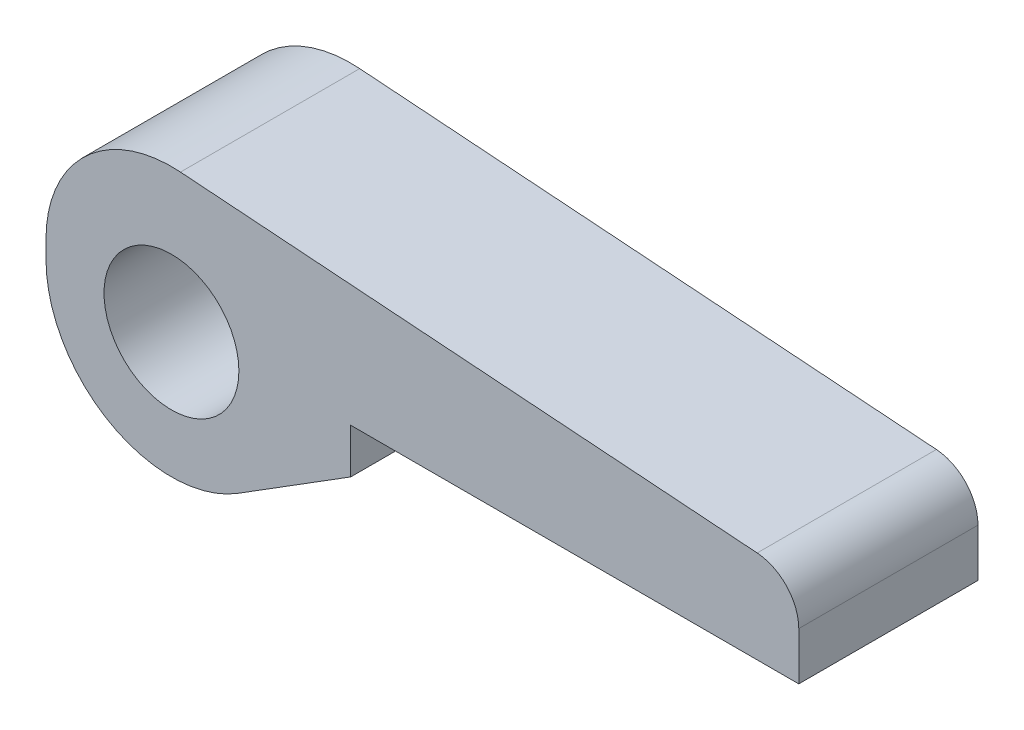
ISO-10303-21;
HEADER;
FILE_DESCRIPTION(('STEP AP214'),'2;1');
FILE_NAME('part.step','',(''),(''),'','','');
FILE_SCHEMA(('AUTOMOTIVE_DESIGN { 1 0 10303 214 1 1 1 1 }'));
ENDSEC;
DATA;
#1=APPLICATION_CONTEXT('core data for automotive mechanical design processes');
#2=APPLICATION_PROTOCOL_DEFINITION('international standard','automotive_design',2000,#1);
#3=PRODUCT_CONTEXT('',#1,'mechanical');
#4=PRODUCT('Part','Part','',(#3));
#5=PRODUCT_RELATED_PRODUCT_CATEGORY('part','',(#4));
#6=PRODUCT_DEFINITION_FORMATION('','',#4);
#7=PRODUCT_DEFINITION_CONTEXT('part definition',#1,'design');
#8=PRODUCT_DEFINITION('design','',#6,#7);
#9=PRODUCT_DEFINITION_SHAPE('','',#8);
#10=(LENGTH_UNIT() NAMED_UNIT(*) SI_UNIT(.MILLI.,.METRE.));
#11=(NAMED_UNIT(*) PLANE_ANGLE_UNIT() SI_UNIT($,.RADIAN.));
#12=(NAMED_UNIT(*) SI_UNIT($,.STERADIAN.) SOLID_ANGLE_UNIT());
#13=UNCERTAINTY_MEASURE_WITH_UNIT(LENGTH_MEASURE(1.E-05),#10,'distance_accuracy_value','');
#14=(GEOMETRIC_REPRESENTATION_CONTEXT(3) GLOBAL_UNCERTAINTY_ASSIGNED_CONTEXT((#13)) GLOBAL_UNIT_ASSIGNED_CONTEXT((#10,
#11,#12)) REPRESENTATION_CONTEXT('',''));
#15=CARTESIAN_POINT('',(0.,0.,0.));
#16=DIRECTION('',(0.,0.,1.));
#17=DIRECTION('',(1.,0.,0.));
#18=AXIS2_PLACEMENT_3D('',#15,#16,#17);
#19=CARTESIAN_POINT('',(0.,0.,40.));
#20=DIRECTION('',(0.,0.,1.));
#21=DIRECTION('',(1.,0.,0.));
#22=AXIS2_PLACEMENT_3D('',#19,#20,#21);
#23=PLANE('',#22);
#24=DIRECTION('',(0.,1.,0.));
#25=VECTOR('',#24,1.);
#26=CARTESIAN_POINT('',(40.,0.,40.));
#27=LINE('',#26,#25);
#28=CARTESIAN_POINT('',(40.,-8.,40.));
#29=VERTEX_POINT('',#28);
#30=CARTESIAN_POINT('',(40.,2.,40.));
#31=VERTEX_POINT('',#30);
#32=EDGE_CURVE('E137',#29,#31,#27,.T.);
#33=ORIENTED_EDGE('',*,*,#32,.T.);
#34=DIRECTION('',(1.,0.,0.));
#35=VECTOR('',#34,1.);
#36=CARTESIAN_POINT('',(40.,2.,40.));
#37=LINE('',#36,#35);
#38=CARTESIAN_POINT('',(140.,2.,40.));
#39=VERTEX_POINT('',#38);
#40=EDGE_CURVE('E115',#31,#39,#37,.T.);
#41=ORIENTED_EDGE('',*,*,#40,.T.);
#42=DIRECTION('',(0.,1.,0.));
#43=VECTOR('',#42,1.);
#44=CARTESIAN_POINT('',(140.,2.,40.));
#45=LINE('',#44,#43);
#46=CARTESIAN_POINT('',(140.,12.6936078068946,40.));
#47=VERTEX_POINT('',#46);
#48=EDGE_CURVE('E140',#39,#47,#45,.T.);
#49=ORIENTED_EDGE('',*,*,#48,.T.);
#50=CARTESIAN_POINT('',(130.,12.6936078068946,40.));
#51=DIRECTION('',(0.,0.,1.));
#52=DIRECTION('',(1.,0.,0.));
#53=AXIS2_PLACEMENT_3D('',#50,#51,#52);
#54=CIRCLE('',#53,10.);
#55=CARTESIAN_POINT('',(130.717600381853,22.6678270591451,40.));
#56=VERTEX_POINT('',#55);
#57=EDGE_CURVE('E142',#47,#56,#54,.T.);
#58=ORIENTED_EDGE('',*,*,#57,.T.);
#59=DIRECTION('',(-0.997421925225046,0.0717600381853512,0.));
#60=VECTOR('',#59,1.);
#61=CARTESIAN_POINT('',(2.00928106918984,31.9278139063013,40.));
#62=LINE('',#61,#60);
#63=CARTESIAN_POINT('',(2.00928106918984,31.9278139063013,40.));
#64=VERTEX_POINT('',#63);
#65=EDGE_CURVE('E144',#56,#64,#62,.T.);
#66=ORIENTED_EDGE('',*,*,#65,.T.);
#67=CARTESIAN_POINT('',(0.,4.,40.));
#68=DIRECTION('',(0.,0.,1.));
#69=DIRECTION('',(-1.,0.,0.));
#70=AXIS2_PLACEMENT_3D('',#67,#68,#69);
#71=CIRCLE('',#70,28.);
#72=CARTESIAN_POINT('',(-28.,4.,40.));
#73=VERTEX_POINT('',#72);
#74=EDGE_CURVE('E146',#64,#73,#71,.T.);
#75=ORIENTED_EDGE('',*,*,#74,.T.);
#76=DIRECTION('',(0.,-1.,0.));
#77=VECTOR('',#76,1.);
#78=CARTESIAN_POINT('',(-28.,0.,40.));
#79=LINE('',#78,#77);
#80=CARTESIAN_POINT('',(-28.,0.,40.));
#81=VERTEX_POINT('',#80);
#82=EDGE_CURVE('E148',#73,#81,#79,.T.);
#83=ORIENTED_EDGE('',*,*,#82,.T.);
#84=CARTESIAN_POINT('',(0.,0.,40.));
#85=DIRECTION('',(0.,0.,1.));
#86=DIRECTION('',(1.,0.,0.));
#87=AXIS2_PLACEMENT_3D('',#84,#85,#86);
#88=CIRCLE('',#87,28.);
#89=CARTESIAN_POINT('',(14.8528161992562,-23.7359190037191,40.));
#90=VERTEX_POINT('',#89);
#91=EDGE_CURVE('E50',#81,#90,#88,.T.);
#92=ORIENTED_EDGE('',*,*,#91,.T.);
#93=DIRECTION('',(0.847711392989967,0.530457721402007,0.));
#94=VECTOR('',#93,1.);
#95=CARTESIAN_POINT('',(40.,-8.,40.));
#96=LINE('',#95,#94);
#97=EDGE_CURVE('E45',#90,#29,#96,.T.);
#98=ORIENTED_EDGE('',*,*,#97,.T.);
#99=EDGE_LOOP('',(#33,#41,#49,#58,#66,#75,#83,#92,#98));
#100=FACE_BOUND('',#99,.T.);
#101=CARTESIAN_POINT('',(0.,0.,40.));
#102=DIRECTION('',(0.,0.,1.));
#103=DIRECTION('',(1.,0.,0.));
#104=AXIS2_PLACEMENT_3D('',#101,#102,#103);
#105=CIRCLE('',#104,15.05);
#106=CARTESIAN_POINT('',(15.05,0.,40.));
#107=VERTEX_POINT('',#106);
#108=EDGE_CURVE('E109',#107,#107,#105,.T.);
#109=ORIENTED_EDGE('',*,*,#108,.F.);
#110=EDGE_LOOP('',(#109));
#111=FACE_BOUND('',#110,.T.);
#112=ADVANCED_FACE('F30',(#100,#111),#23,.T.);
#113=CARTESIAN_POINT('',(0.,0.,0.));
#114=DIRECTION('',(0.,0.,1.));
#115=DIRECTION('',(1.,0.,0.));
#116=AXIS2_PLACEMENT_3D('',#113,#114,#115);
#117=PLANE('',#116);
#118=DIRECTION('',(0.,1.,0.));
#119=VECTOR('',#118,1.);
#120=CARTESIAN_POINT('',(40.,0.,0.));
#121=LINE('',#120,#119);
#122=CARTESIAN_POINT('',(40.,-8.,0.));
#123=VERTEX_POINT('',#122);
#124=CARTESIAN_POINT('',(40.,2.,0.));
#125=VERTEX_POINT('',#124);
#126=EDGE_CURVE('E100',#123,#125,#121,.T.);
#127=ORIENTED_EDGE('',*,*,#126,.F.);
#128=DIRECTION('',(0.847711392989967,0.530457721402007,0.));
#129=VECTOR('',#128,1.);
#130=CARTESIAN_POINT('',(40.,-8.,0.));
#131=LINE('',#130,#129);
#132=CARTESIAN_POINT('',(14.8528161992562,-23.7359190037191,0.));
#133=VERTEX_POINT('',#132);
#134=EDGE_CURVE('E135',#133,#123,#131,.T.);
#135=ORIENTED_EDGE('',*,*,#134,.F.);
#136=CARTESIAN_POINT('',(0.,0.,0.));
#137=DIRECTION('',(0.,0.,1.));
#138=DIRECTION('',(1.,0.,0.));
#139=AXIS2_PLACEMENT_3D('',#136,#137,#138);
#140=CIRCLE('',#139,28.);
#141=CARTESIAN_POINT('',(-28.,0.,0.));
#142=VERTEX_POINT('',#141);
#143=EDGE_CURVE('E133',#142,#133,#140,.T.);
#144=ORIENTED_EDGE('',*,*,#143,.F.);
#145=DIRECTION('',(0.,-1.,0.));
#146=VECTOR('',#145,1.);
#147=CARTESIAN_POINT('',(-28.,0.,0.));
#148=LINE('',#147,#146);
#149=CARTESIAN_POINT('',(-28.,4.,0.));
#150=VERTEX_POINT('',#149);
#151=EDGE_CURVE('E131',#150,#142,#148,.T.);
#152=ORIENTED_EDGE('',*,*,#151,.F.);
#153=CARTESIAN_POINT('',(0.,4.,0.));
#154=DIRECTION('',(0.,0.,1.));
#155=DIRECTION('',(-1.,0.,0.));
#156=AXIS2_PLACEMENT_3D('',#153,#154,#155);
#157=CIRCLE('',#156,28.);
#158=CARTESIAN_POINT('',(2.00928106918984,31.9278139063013,0.));
#159=VERTEX_POINT('',#158);
#160=EDGE_CURVE('E129',#159,#150,#157,.T.);
#161=ORIENTED_EDGE('',*,*,#160,.F.);
#162=DIRECTION('',(-0.997421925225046,0.0717600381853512,0.));
#163=VECTOR('',#162,1.);
#164=CARTESIAN_POINT('',(2.00928106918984,31.9278139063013,0.));
#165=LINE('',#164,#163);
#166=CARTESIAN_POINT('',(130.717600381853,22.6678270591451,0.));
#167=VERTEX_POINT('',#166);
#168=EDGE_CURVE('E127',#167,#159,#165,.T.);
#169=ORIENTED_EDGE('',*,*,#168,.F.);
#170=CARTESIAN_POINT('',(130.,12.6936078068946,0.));
#171=DIRECTION('',(0.,0.,1.));
#172=DIRECTION('',(1.,0.,0.));
#173=AXIS2_PLACEMENT_3D('',#170,#171,#172);
#174=CIRCLE('',#173,10.);
#175=CARTESIAN_POINT('',(140.,12.6936078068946,0.));
#176=VERTEX_POINT('',#175);
#177=EDGE_CURVE('E122',#176,#167,#174,.T.);
#178=ORIENTED_EDGE('',*,*,#177,.F.);
#179=DIRECTION('',(0.,1.,0.));
#180=VECTOR('',#179,1.);
#181=CARTESIAN_POINT('',(140.,2.,0.));
#182=LINE('',#181,#180);
#183=CARTESIAN_POINT('',(140.,2.,0.));
#184=VERTEX_POINT('',#183);
#185=EDGE_CURVE('E120',#184,#176,#182,.T.);
#186=ORIENTED_EDGE('',*,*,#185,.F.);
#187=DIRECTION('',(1.,0.,0.));
#188=VECTOR('',#187,1.);
#189=CARTESIAN_POINT('',(40.,2.,0.));
#190=LINE('',#189,#188);
#191=EDGE_CURVE('E108',#125,#184,#190,.T.);
#192=ORIENTED_EDGE('',*,*,#191,.F.);
#193=EDGE_LOOP('',(#127,#135,#144,#152,#161,#169,#178,#186,#192));
#194=FACE_BOUND('',#193,.T.);
#195=CARTESIAN_POINT('',(0.,0.,0.));
#196=DIRECTION('',(0.,0.,1.));
#197=DIRECTION('',(1.,0.,0.));
#198=AXIS2_PLACEMENT_3D('',#195,#196,#197);
#199=CIRCLE('',#198,15.05);
#200=CARTESIAN_POINT('',(15.05,0.,0.));
#201=VERTEX_POINT('',#200);
#202=EDGE_CURVE('E303',#201,#201,#199,.T.);
#203=ORIENTED_EDGE('',*,*,#202,.T.);
#204=EDGE_LOOP('',(#203));
#205=FACE_BOUND('',#204,.T.);
#206=ADVANCED_FACE('F117',(#194,#205),#117,.F.);
#207=CARTESIAN_POINT('',(40.,0.,40.));
#208=DIRECTION('',(-1.,0.,0.));
#209=DIRECTION('',(0.,0.,1.));
#210=AXIS2_PLACEMENT_3D('',#207,#208,#209);
#211=PLANE('',#210);
#212=ORIENTED_EDGE('',*,*,#126,.T.);
#213=DIRECTION('',(0.,0.,-1.));
#214=VECTOR('',#213,1.);
#215=CARTESIAN_POINT('',(40.,2.,40.));
#216=LINE('',#215,#214);
#217=EDGE_CURVE('E11',#31,#125,#216,.T.);
#218=ORIENTED_EDGE('',*,*,#217,.F.);
#219=ORIENTED_EDGE('',*,*,#32,.F.);
#220=DIRECTION('',(0.,0.,-1.));
#221=VECTOR('',#220,1.);
#222=CARTESIAN_POINT('',(40.,-8.,40.));
#223=LINE('',#222,#221);
#224=EDGE_CURVE('E103',#29,#123,#223,.T.);
#225=ORIENTED_EDGE('',*,*,#224,.T.);
#226=EDGE_LOOP('',(#212,#218,#219,#225));
#227=FACE_BOUND('',#226,.T.);
#228=ADVANCED_FACE('F32',(#227),#211,.F.);
#229=CARTESIAN_POINT('',(40.,2.,40.));
#230=DIRECTION('',(0.,1.,0.));
#231=DIRECTION('',(0.,0.,1.));
#232=AXIS2_PLACEMENT_3D('',#229,#230,#231);
#233=PLANE('',#232);
#234=ORIENTED_EDGE('',*,*,#191,.T.);
#235=DIRECTION('',(0.,0.,-1.));
#236=VECTOR('',#235,1.);
#237=CARTESIAN_POINT('',(140.,2.,40.));
#238=LINE('',#237,#236);
#239=EDGE_CURVE('E38',#39,#184,#238,.T.);
#240=ORIENTED_EDGE('',*,*,#239,.F.);
#241=ORIENTED_EDGE('',*,*,#40,.F.);
#242=ORIENTED_EDGE('',*,*,#217,.T.);
#243=EDGE_LOOP('',(#234,#240,#241,#242));
#244=FACE_BOUND('',#243,.T.);
#245=ADVANCED_FACE('F112',(#244),#233,.F.);
#246=CARTESIAN_POINT('',(140.,2.,40.));
#247=DIRECTION('',(-1.,0.,0.));
#248=DIRECTION('',(0.,0.,1.));
#249=AXIS2_PLACEMENT_3D('',#246,#247,#248);
#250=PLANE('',#249);
#251=ORIENTED_EDGE('',*,*,#185,.T.);
#252=DIRECTION('',(0.,0.,-1.));
#253=VECTOR('',#252,1.);
#254=CARTESIAN_POINT('',(140.,12.6936078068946,40.));
#255=LINE('',#254,#253);
#256=EDGE_CURVE('E168',#47,#176,#255,.T.);
#257=ORIENTED_EDGE('',*,*,#256,.F.);
#258=ORIENTED_EDGE('',*,*,#48,.F.);
#259=ORIENTED_EDGE('',*,*,#239,.T.);
#260=EDGE_LOOP('',(#251,#257,#258,#259));
#261=FACE_BOUND('',#260,.T.);
#262=ADVANCED_FACE('F172',(#261),#250,.F.);
#263=CARTESIAN_POINT('',(130.,12.6936078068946,40.));
#264=DIRECTION('',(0.,0.,-1.));
#265=DIRECTION('',(-1.,0.,0.));
#266=AXIS2_PLACEMENT_3D('',#263,#264,#265);
#267=CYLINDRICAL_SURFACE('',#266,10.);
#268=ORIENTED_EDGE('',*,*,#177,.T.);
#269=DIRECTION('',(0.,0.,-1.));
#270=VECTOR('',#269,1.);
#271=CARTESIAN_POINT('',(130.717600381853,22.6678270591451,40.));
#272=LINE('',#271,#270);
#273=EDGE_CURVE('E165',#56,#167,#272,.T.);
#274=ORIENTED_EDGE('',*,*,#273,.F.);
#275=ORIENTED_EDGE('',*,*,#57,.F.);
#276=ORIENTED_EDGE('',*,*,#256,.T.);
#277=EDGE_LOOP('',(#268,#274,#275,#276));
#278=FACE_BOUND('',#277,.T.);
#279=ADVANCED_FACE('F180',(#278),#267,.T.);
#280=CARTESIAN_POINT('',(2.00928106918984,31.9278139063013,40.));
#281=DIRECTION('',(-0.0717600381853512,-0.997421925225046,0.));
#282=DIRECTION('',(0.997421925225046,-0.0717600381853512,0.));
#283=AXIS2_PLACEMENT_3D('',#280,#281,#282);
#284=PLANE('',#283);
#285=ORIENTED_EDGE('',*,*,#168,.T.);
#286=DIRECTION('',(0.,0.,-1.));
#287=VECTOR('',#286,1.);
#288=CARTESIAN_POINT('',(2.00928106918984,31.9278139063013,40.));
#289=LINE('',#288,#287);
#290=EDGE_CURVE('E162',#64,#159,#289,.T.);
#291=ORIENTED_EDGE('',*,*,#290,.F.);
#292=ORIENTED_EDGE('',*,*,#65,.F.);
#293=ORIENTED_EDGE('',*,*,#273,.T.);
#294=EDGE_LOOP('',(#285,#291,#292,#293));
#295=FACE_BOUND('',#294,.T.);
#296=ADVANCED_FACE('F183',(#295),#284,.F.);
#297=CARTESIAN_POINT('',(0.,4.,40.));
#298=DIRECTION('',(0.,0.,-1.));
#299=DIRECTION('',(-1.,0.,0.));
#300=AXIS2_PLACEMENT_3D('',#297,#298,#299);
#301=CYLINDRICAL_SURFACE('',#300,28.);
#302=ORIENTED_EDGE('',*,*,#160,.T.);
#303=DIRECTION('',(0.,0.,-1.));
#304=VECTOR('',#303,1.);
#305=CARTESIAN_POINT('',(-28.,4.,40.));
#306=LINE('',#305,#304);
#307=EDGE_CURVE('E159',#73,#150,#306,.T.);
#308=ORIENTED_EDGE('',*,*,#307,.F.);
#309=ORIENTED_EDGE('',*,*,#74,.F.);
#310=ORIENTED_EDGE('',*,*,#290,.T.);
#311=EDGE_LOOP('',(#302,#308,#309,#310));
#312=FACE_BOUND('',#311,.T.);
#313=ADVANCED_FACE('F188',(#312),#301,.T.);
#314=CARTESIAN_POINT('',(-28.,0.,40.));
#315=DIRECTION('',(1.,0.,0.));
#316=DIRECTION('',(0.,0.,-1.));
#317=AXIS2_PLACEMENT_3D('',#314,#315,#316);
#318=PLANE('',#317);
#319=ORIENTED_EDGE('',*,*,#151,.T.);
#320=DIRECTION('',(0.,0.,-1.));
#321=VECTOR('',#320,1.);
#322=CARTESIAN_POINT('',(-28.,0.,40.));
#323=LINE('',#322,#321);
#324=EDGE_CURVE('E156',#81,#142,#323,.T.);
#325=ORIENTED_EDGE('',*,*,#324,.F.);
#326=ORIENTED_EDGE('',*,*,#82,.F.);
#327=ORIENTED_EDGE('',*,*,#307,.T.);
#328=EDGE_LOOP('',(#319,#325,#326,#327));
#329=FACE_BOUND('',#328,.T.);
#330=ADVANCED_FACE('F192',(#329),#318,.F.);
#331=CARTESIAN_POINT('',(0.,0.,40.));
#332=DIRECTION('',(0.,0.,-1.));
#333=DIRECTION('',(-1.,0.,0.));
#334=AXIS2_PLACEMENT_3D('',#331,#332,#333);
#335=CYLINDRICAL_SURFACE('',#334,28.);
#336=ORIENTED_EDGE('',*,*,#143,.T.);
#337=DIRECTION('',(0.,0.,-1.));
#338=VECTOR('',#337,1.);
#339=CARTESIAN_POINT('',(14.8528161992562,-23.7359190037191,40.));
#340=LINE('',#339,#338);
#341=EDGE_CURVE('E153',#90,#133,#340,.T.);
#342=ORIENTED_EDGE('',*,*,#341,.F.);
#343=ORIENTED_EDGE('',*,*,#91,.F.);
#344=ORIENTED_EDGE('',*,*,#324,.T.);
#345=EDGE_LOOP('',(#336,#342,#343,#344));
#346=FACE_BOUND('',#345,.T.);
#347=ADVANCED_FACE('F196',(#346),#335,.T.);
#348=CARTESIAN_POINT('',(40.,-8.,40.));
#349=DIRECTION('',(-0.530457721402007,0.847711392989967,0.));
#350=DIRECTION('',(-0.847711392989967,-0.530457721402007,0.));
#351=AXIS2_PLACEMENT_3D('',#348,#349,#350);
#352=PLANE('',#351);
#353=ORIENTED_EDGE('',*,*,#134,.T.);
#354=ORIENTED_EDGE('',*,*,#224,.F.);
#355=ORIENTED_EDGE('',*,*,#97,.F.);
#356=ORIENTED_EDGE('',*,*,#341,.T.);
#357=EDGE_LOOP('',(#353,#354,#355,#356));
#358=FACE_BOUND('',#357,.T.);
#359=ADVANCED_FACE('F198',(#358),#352,.F.);
#360=CARTESIAN_POINT('',(0.,0.,40.));
#361=DIRECTION('',(0.,0.,-1.));
#362=DIRECTION('',(-1.,0.,0.));
#363=AXIS2_PLACEMENT_3D('',#360,#361,#362);
#364=CYLINDRICAL_SURFACE('',#363,15.05);
#365=ORIENTED_EDGE('',*,*,#108,.T.);
#366=EDGE_LOOP('',(#365));
#367=FACE_BOUND('',#366,.T.);
#368=ORIENTED_EDGE('',*,*,#202,.F.);
#369=EDGE_LOOP('',(#368));
#370=FACE_BOUND('',#369,.T.);
#371=ADVANCED_FACE('F200',(#367,#370),#364,.F.);
#372=CLOSED_SHELL('',(#112,#206,#228,#245,#262,#279,#296,#313,#330,#347,#359,#371));
#373=MANIFOLD_SOLID_BREP('B2',#372);
#374=ADVANCED_BREP_SHAPE_REPRESENTATION('',(#18,#373),#14);
#375=SHAPE_DEFINITION_REPRESENTATION(#9,#374);
ENDSEC;
END-ISO-10303-21;
